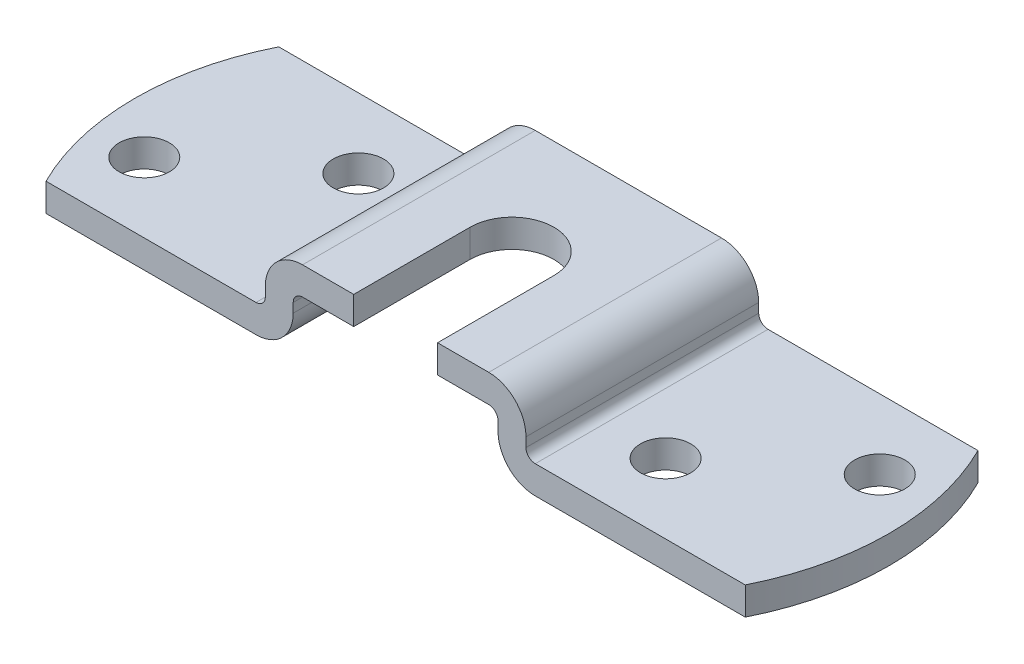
ISO-10303-21;
HEADER;
FILE_DESCRIPTION(('STEP AP214'),'2;1');
FILE_NAME('part.step','',(''),(''),'','','');
FILE_SCHEMA(('AUTOMOTIVE_DESIGN { 1 0 10303 214 1 1 1 1 }'));
ENDSEC;
DATA;
#1=APPLICATION_CONTEXT('core data for automotive mechanical design processes');
#2=APPLICATION_PROTOCOL_DEFINITION('international standard','automotive_design',2000,#1);
#3=PRODUCT_CONTEXT('',#1,'mechanical');
#4=PRODUCT('Part','Part','',(#3));
#5=PRODUCT_RELATED_PRODUCT_CATEGORY('part','',(#4));
#6=PRODUCT_DEFINITION_FORMATION('','',#4);
#7=PRODUCT_DEFINITION_CONTEXT('part definition',#1,'design');
#8=PRODUCT_DEFINITION('design','',#6,#7);
#9=PRODUCT_DEFINITION_SHAPE('','',#8);
#10=(LENGTH_UNIT() NAMED_UNIT(*) SI_UNIT(.MILLI.,.METRE.));
#11=(NAMED_UNIT(*) PLANE_ANGLE_UNIT() SI_UNIT($,.RADIAN.));
#12=(NAMED_UNIT(*) SI_UNIT($,.STERADIAN.) SOLID_ANGLE_UNIT());
#13=UNCERTAINTY_MEASURE_WITH_UNIT(LENGTH_MEASURE(1.E-05),#10,'distance_accuracy_value','');
#14=(GEOMETRIC_REPRESENTATION_CONTEXT(3) GLOBAL_UNCERTAINTY_ASSIGNED_CONTEXT((#13)) GLOBAL_UNIT_ASSIGNED_CONTEXT((#10,
#11,#12)) REPRESENTATION_CONTEXT('',''));
#15=CARTESIAN_POINT('',(0.,0.,0.));
#16=DIRECTION('',(0.,0.,1.));
#17=DIRECTION('',(1.,0.,0.));
#18=AXIS2_PLACEMENT_3D('',#15,#16,#17);
#19=CARTESIAN_POINT('',(10.,-4.,25.));
#20=DIRECTION('',(0.,0.,-1.));
#21=DIRECTION('',(-1.,0.,0.));
#22=AXIS2_PLACEMENT_3D('',#19,#20,#21);
#23=PLANE('',#22);
#24=DIRECTION('',(1.,0.,0.));
#25=VECTOR('',#24,1.);
#26=CARTESIAN_POINT('',(10.,-3.,25.));
#27=LINE('',#26,#25);
#28=CARTESIAN_POINT('',(-10.,-3.,25.));
#29=VERTEX_POINT('',#28);
#30=CARTESIAN_POINT('',(-4.5,-3.,25.));
#31=VERTEX_POINT('',#30);
#32=EDGE_CURVE('E277',#29,#31,#27,.T.);
#33=ORIENTED_EDGE('',*,*,#32,.T.);
#34=DIRECTION('',(0.,1.,0.));
#35=VECTOR('',#34,1.);
#36=CARTESIAN_POINT('',(-4.5,-9.00000000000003,25.));
#37=LINE('',#36,#35);
#38=CARTESIAN_POINT('',(-4.5,0.,25.));
#39=VERTEX_POINT('',#38);
#40=EDGE_CURVE('E391',#31,#39,#37,.T.);
#41=ORIENTED_EDGE('',*,*,#40,.T.);
#42=DIRECTION('',(-1.,0.,0.));
#43=VECTOR('',#42,1.);
#44=CARTESIAN_POINT('',(10.,0.,25.));
#45=LINE('',#44,#43);
#46=CARTESIAN_POINT('',(-10.,0.,25.));
#47=VERTEX_POINT('',#46);
#48=EDGE_CURVE('E255',#39,#47,#45,.T.);
#49=ORIENTED_EDGE('',*,*,#48,.T.);
#50=CARTESIAN_POINT('',(-10.,-4.,25.));
#51=DIRECTION('',(0.,0.,1.));
#52=DIRECTION('',(1.,0.,0.));
#53=AXIS2_PLACEMENT_3D('',#50,#51,#52);
#54=CIRCLE('',#53,4.);
#55=CARTESIAN_POINT('',(-14.,-4.,25.));
#56=VERTEX_POINT('',#55);
#57=EDGE_CURVE('E254',#47,#56,#54,.T.);
#58=ORIENTED_EDGE('',*,*,#57,.T.);
#59=DIRECTION('',(0.,-1.,0.));
#60=VECTOR('',#59,1.);
#61=CARTESIAN_POINT('',(-14.,-4.,25.));
#62=LINE('',#61,#60);
#63=CARTESIAN_POINT('',(-14.,-5.,25.));
#64=VERTEX_POINT('',#63);
#65=EDGE_CURVE('E257',#56,#64,#62,.T.);
#66=ORIENTED_EDGE('',*,*,#65,.T.);
#67=CARTESIAN_POINT('',(-15.,-5.,25.));
#68=DIRECTION('',(0.,0.,-1.));
#69=DIRECTION('',(-1.,0.,0.));
#70=AXIS2_PLACEMENT_3D('',#67,#68,#69);
#71=CIRCLE('',#70,1.);
#72=CARTESIAN_POINT('',(-15.,-6.,25.));
#73=VERTEX_POINT('',#72);
#74=EDGE_CURVE('E263',#64,#73,#71,.T.);
#75=ORIENTED_EDGE('',*,*,#74,.T.);
#76=DIRECTION('',(-1.,0.,0.));
#77=VECTOR('',#76,1.);
#78=CARTESIAN_POINT('',(-15.,-6.,25.));
#79=LINE('',#78,#77);
#80=CARTESIAN_POINT('',(-37.5549396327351,-6.00000000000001,25.));
#81=VERTEX_POINT('',#80);
#82=EDGE_CURVE('E265',#73,#81,#79,.T.);
#83=ORIENTED_EDGE('',*,*,#82,.T.);
#84=DIRECTION('',(0.,1.,0.));
#85=VECTOR('',#84,1.);
#86=CARTESIAN_POINT('',(-37.5549396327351,-9.00000000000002,25.));
#87=LINE('',#86,#85);
#88=CARTESIAN_POINT('',(-37.5549396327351,-9.00000000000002,25.));
#89=VERTEX_POINT('',#88);
#90=EDGE_CURVE('E406',#89,#81,#87,.T.);
#91=ORIENTED_EDGE('',*,*,#90,.F.);
#92=DIRECTION('',(1.,0.,0.));
#93=VECTOR('',#92,1.);
#94=CARTESIAN_POINT('',(-15.,-9.,25.));
#95=LINE('',#94,#93);
#96=CARTESIAN_POINT('',(-15.,-9.,25.));
#97=VERTEX_POINT('',#96);
#98=EDGE_CURVE('E268',#89,#97,#95,.T.);
#99=ORIENTED_EDGE('',*,*,#98,.T.);
#100=CARTESIAN_POINT('',(-15.,-5.,25.));
#101=DIRECTION('',(0.,0.,1.));
#102=DIRECTION('',(-1.,0.,0.));
#103=AXIS2_PLACEMENT_3D('',#100,#101,#102);
#104=CIRCLE('',#103,4.);
#105=CARTESIAN_POINT('',(-11.,-5.,25.));
#106=VERTEX_POINT('',#105);
#107=EDGE_CURVE('E270',#97,#106,#104,.T.);
#108=ORIENTED_EDGE('',*,*,#107,.T.);
#109=DIRECTION('',(0.,1.,0.));
#110=VECTOR('',#109,1.);
#111=CARTESIAN_POINT('',(-11.,-4.,25.));
#112=LINE('',#111,#110);
#113=CARTESIAN_POINT('',(-11.,-4.,25.));
#114=VERTEX_POINT('',#113);
#115=EDGE_CURVE('E272',#106,#114,#112,.T.);
#116=ORIENTED_EDGE('',*,*,#115,.T.);
#117=CARTESIAN_POINT('',(-10.,-4.,25.));
#118=DIRECTION('',(0.,0.,-1.));
#119=DIRECTION('',(1.,0.,0.));
#120=AXIS2_PLACEMENT_3D('',#117,#118,#119);
#121=CIRCLE('',#120,1.);
#122=EDGE_CURVE('E274',#114,#29,#121,.T.);
#123=ORIENTED_EDGE('',*,*,#122,.T.);
#124=EDGE_LOOP('',(#33,#41,#49,#58,#66,#75,#83,#91,#99,#108,#116,#123));
#125=FACE_BOUND('',#124,.T.);
#126=ADVANCED_FACE('F68',(#125),#23,.F.);
#127=CARTESIAN_POINT('',(-15.,-6.,25.));
#128=DIRECTION('',(0.,-1.,0.));
#129=DIRECTION('',(1.,0.,0.));
#130=AXIS2_PLACEMENT_3D('',#127,#128,#129);
#131=PLANE('',#130);
#132=CARTESIAN_POINT('',(-21.5,-6.00000000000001,7.5));
#133=DIRECTION('',(0.,1.,0.));
#134=DIRECTION('',(-1.,0.,0.));
#135=AXIS2_PLACEMENT_3D('',#132,#133,#134);
#136=CIRCLE('',#135,2.7);
#137=CARTESIAN_POINT('',(-24.2,-6.00000000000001,7.5));
#138=VERTEX_POINT('',#137);
#139=EDGE_CURVE('E509',#138,#138,#136,.T.);
#140=ORIENTED_EDGE('',*,*,#139,.F.);
#141=EDGE_LOOP('',(#140));
#142=FACE_BOUND('',#141,.T.);
#143=CARTESIAN_POINT('',(-34.5,-6.00000000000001,17.5));
#144=DIRECTION('',(0.,1.,0.));
#145=DIRECTION('',(-1.,0.,0.));
#146=AXIS2_PLACEMENT_3D('',#143,#144,#145);
#147=CIRCLE('',#146,2.7);
#148=CARTESIAN_POINT('',(-37.2,-6.00000000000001,17.5));
#149=VERTEX_POINT('',#148);
#150=EDGE_CURVE('E503',#149,#149,#147,.T.);
#151=ORIENTED_EDGE('',*,*,#150,.F.);
#152=EDGE_LOOP('',(#151));
#153=FACE_BOUND('',#152,.T.);
#154=CARTESIAN_POINT('',(-12.5,-6.,12.5));
#155=DIRECTION('',(0.,1.,0.));
#156=DIRECTION('',(-1.,0.,0.));
#157=AXIS2_PLACEMENT_3D('',#154,#155,#156);
#158=CIRCLE('',#157,28.);
#159=CARTESIAN_POINT('',(-37.5549396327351,-6.00000000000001,0.));
#160=VERTEX_POINT('',#159);
#161=EDGE_CURVE('E409',#160,#81,#158,.T.);
#162=ORIENTED_EDGE('',*,*,#161,.T.);
#163=ORIENTED_EDGE('',*,*,#82,.F.);
#164=DIRECTION('',(0.,0.,-1.));
#165=VECTOR('',#164,1.);
#166=CARTESIAN_POINT('',(-15.,-6.,25.));
#167=LINE('',#166,#165);
#168=CARTESIAN_POINT('',(-15.,-6.,0.));
#169=VERTEX_POINT('',#168);
#170=EDGE_CURVE('E368',#73,#169,#167,.T.);
#171=ORIENTED_EDGE('',*,*,#170,.T.);
#172=DIRECTION('',(-1.,0.,0.));
#173=VECTOR('',#172,1.);
#174=CARTESIAN_POINT('',(-15.,-6.,0.));
#175=LINE('',#174,#173);
#176=EDGE_CURVE('E308',#169,#160,#175,.T.);
#177=ORIENTED_EDGE('',*,*,#176,.T.);
#178=EDGE_LOOP('',(#162,#163,#171,#177));
#179=FACE_BOUND('',#178,.T.);
#180=ADVANCED_FACE('F422',(#142,#153,#179),#131,.F.);
#181=CARTESIAN_POINT('',(-15.,-9.,25.));
#182=DIRECTION('',(0.,1.,0.));
#183=DIRECTION('',(-1.,0.,0.));
#184=AXIS2_PLACEMENT_3D('',#181,#182,#183);
#185=PLANE('',#184);
#186=CARTESIAN_POINT('',(-21.5,-9.00000000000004,7.5));
#187=DIRECTION('',(0.,1.,0.));
#188=DIRECTION('',(-1.,0.,0.));
#189=AXIS2_PLACEMENT_3D('',#186,#187,#188);
#190=CIRCLE('',#189,2.7);
#191=CARTESIAN_POINT('',(-24.2,-9.00000000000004,7.5));
#192=VERTEX_POINT('',#191);
#193=EDGE_CURVE('E506',#192,#192,#190,.T.);
#194=ORIENTED_EDGE('',*,*,#193,.T.);
#195=EDGE_LOOP('',(#194));
#196=FACE_BOUND('',#195,.T.);
#197=CARTESIAN_POINT('',(-34.5,-9.00000000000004,17.5));
#198=DIRECTION('',(0.,1.,0.));
#199=DIRECTION('',(-1.,0.,0.));
#200=AXIS2_PLACEMENT_3D('',#197,#198,#199);
#201=CIRCLE('',#200,2.7);
#202=CARTESIAN_POINT('',(-37.2,-9.00000000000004,17.5));
#203=VERTEX_POINT('',#202);
#204=EDGE_CURVE('E248',#203,#203,#201,.T.);
#205=ORIENTED_EDGE('',*,*,#204,.T.);
#206=EDGE_LOOP('',(#205));
#207=FACE_BOUND('',#206,.T.);
#208=ORIENTED_EDGE('',*,*,#98,.F.);
#209=CARTESIAN_POINT('',(-12.5,-9.00000000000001,12.5));
#210=DIRECTION('',(0.,1.,0.));
#211=DIRECTION('',(-1.,0.,0.));
#212=AXIS2_PLACEMENT_3D('',#209,#210,#211);
#213=CIRCLE('',#212,28.);
#214=CARTESIAN_POINT('',(-37.5549396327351,-9.00000000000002,0.));
#215=VERTEX_POINT('',#214);
#216=EDGE_CURVE('E410',#215,#89,#213,.T.);
#217=ORIENTED_EDGE('',*,*,#216,.F.);
#218=DIRECTION('',(1.,0.,0.));
#219=VECTOR('',#218,1.);
#220=CARTESIAN_POINT('',(-15.,-9.,0.));
#221=LINE('',#220,#219);
#222=CARTESIAN_POINT('',(-15.,-9.,0.));
#223=VERTEX_POINT('',#222);
#224=EDGE_CURVE('E311',#215,#223,#221,.T.);
#225=ORIENTED_EDGE('',*,*,#224,.T.);
#226=DIRECTION('',(0.,0.,-1.));
#227=VECTOR('',#226,1.);
#228=CARTESIAN_POINT('',(-15.,-9.,25.));
#229=LINE('',#228,#227);
#230=EDGE_CURVE('E365',#97,#223,#229,.T.);
#231=ORIENTED_EDGE('',*,*,#230,.F.);
#232=EDGE_LOOP('',(#208,#217,#225,#231));
#233=FACE_BOUND('',#232,.T.);
#234=ADVANCED_FACE('F496',(#196,#207,#233),#185,.F.);
#235=CARTESIAN_POINT('',(10.,0.,25.));
#236=VERTEX_POINT('',#235);
#237=CARTESIAN_POINT('',(4.5,0.,25.));
#238=VERTEX_POINT('',#237);
#239=EDGE_CURVE('E243',#236,#238,#45,.T.);
#240=ORIENTED_EDGE('',*,*,#239,.T.);
#241=DIRECTION('',(0.,1.,0.));
#242=VECTOR('',#241,1.);
#243=CARTESIAN_POINT('',(4.5,-9.00000000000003,25.));
#244=LINE('',#243,#242);
#245=CARTESIAN_POINT('',(4.5,-3.,25.));
#246=VERTEX_POINT('',#245);
#247=EDGE_CURVE('E227',#246,#238,#244,.T.);
#248=ORIENTED_EDGE('',*,*,#247,.F.);
#249=CARTESIAN_POINT('',(10.,-3.,25.));
#250=VERTEX_POINT('',#249);
#251=EDGE_CURVE('E276',#246,#250,#27,.T.);
#252=ORIENTED_EDGE('',*,*,#251,.T.);
#253=CARTESIAN_POINT('',(10.,-4.,25.));
#254=DIRECTION('',(0.,0.,-1.));
#255=DIRECTION('',(-1.,0.,0.));
#256=AXIS2_PLACEMENT_3D('',#253,#254,#255);
#257=CIRCLE('',#256,1.);
#258=CARTESIAN_POINT('',(11.,-4.,25.));
#259=VERTEX_POINT('',#258);
#260=EDGE_CURVE('E280',#250,#259,#257,.T.);
#261=ORIENTED_EDGE('',*,*,#260,.T.);
#262=DIRECTION('',(0.,-1.,0.));
#263=VECTOR('',#262,1.);
#264=CARTESIAN_POINT('',(11.,-4.,25.));
#265=LINE('',#264,#263);
#266=CARTESIAN_POINT('',(11.,-5.,25.));
#267=VERTEX_POINT('',#266);
#268=EDGE_CURVE('E282',#259,#267,#265,.T.);
#269=ORIENTED_EDGE('',*,*,#268,.T.);
#270=CARTESIAN_POINT('',(15.,-5.,25.));
#271=DIRECTION('',(0.,0.,1.));
#272=DIRECTION('',(1.,0.,0.));
#273=AXIS2_PLACEMENT_3D('',#270,#271,#272);
#274=CIRCLE('',#273,4.);
#275=CARTESIAN_POINT('',(15.,-9.,25.));
#276=VERTEX_POINT('',#275);
#277=EDGE_CURVE('E284',#267,#276,#274,.T.);
#278=ORIENTED_EDGE('',*,*,#277,.T.);
#279=DIRECTION('',(1.,0.,0.));
#280=VECTOR('',#279,1.);
#281=CARTESIAN_POINT('',(15.,-9.,25.));
#282=LINE('',#281,#280);
#283=CARTESIAN_POINT('',(37.5549396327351,-9.00000000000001,25.));
#284=VERTEX_POINT('',#283);
#285=EDGE_CURVE('E286',#276,#284,#282,.T.);
#286=ORIENTED_EDGE('',*,*,#285,.T.);
#287=DIRECTION('',(0.,1.,0.));
#288=VECTOR('',#287,1.);
#289=CARTESIAN_POINT('',(37.5549396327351,-9.00000000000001,25.));
#290=LINE('',#289,#288);
#291=CARTESIAN_POINT('',(37.5549396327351,-5.99999999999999,25.));
#292=VERTEX_POINT('',#291);
#293=EDGE_CURVE('E394',#284,#292,#290,.T.);
#294=ORIENTED_EDGE('',*,*,#293,.T.);
#295=DIRECTION('',(-1.,0.,0.));
#296=VECTOR('',#295,1.);
#297=CARTESIAN_POINT('',(15.,-6.,25.));
#298=LINE('',#297,#296);
#299=CARTESIAN_POINT('',(15.,-6.,25.));
#300=VERTEX_POINT('',#299);
#301=EDGE_CURVE('E289',#292,#300,#298,.T.);
#302=ORIENTED_EDGE('',*,*,#301,.T.);
#303=CARTESIAN_POINT('',(15.,-5.,25.));
#304=DIRECTION('',(0.,0.,-1.));
#305=DIRECTION('',(1.,0.,0.));
#306=AXIS2_PLACEMENT_3D('',#303,#304,#305);
#307=CIRCLE('',#306,1.);
#308=CARTESIAN_POINT('',(14.,-5.,25.));
#309=VERTEX_POINT('',#308);
#310=EDGE_CURVE('E291',#300,#309,#307,.T.);
#311=ORIENTED_EDGE('',*,*,#310,.T.);
#312=DIRECTION('',(0.,1.,0.));
#313=VECTOR('',#312,1.);
#314=CARTESIAN_POINT('',(14.,-4.,25.));
#315=LINE('',#314,#313);
#316=CARTESIAN_POINT('',(14.,-4.,25.));
#317=VERTEX_POINT('',#316);
#318=EDGE_CURVE('E293',#309,#317,#315,.T.);
#319=ORIENTED_EDGE('',*,*,#318,.T.);
#320=CARTESIAN_POINT('',(10.,-4.,25.));
#321=DIRECTION('',(0.,0.,1.));
#322=DIRECTION('',(-1.,0.,0.));
#323=AXIS2_PLACEMENT_3D('',#320,#321,#322);
#324=CIRCLE('',#323,4.);
#325=EDGE_CURVE('E252',#317,#236,#324,.T.);
#326=ORIENTED_EDGE('',*,*,#325,.T.);
#327=EDGE_LOOP('',(#240,#248,#252,#261,#269,#278,#286,#294,#302,#311,#319,#326));
#328=FACE_BOUND('',#327,.T.);
#329=ADVANCED_FACE('F250',(#328),#23,.F.);
#330=CARTESIAN_POINT('',(10.,-4.,0.));
#331=DIRECTION('',(0.,0.,-1.));
#332=DIRECTION('',(-1.,0.,0.));
#333=AXIS2_PLACEMENT_3D('',#330,#331,#332);
#334=PLANE('',#333);
#335=DIRECTION('',(0.,1.,0.));
#336=VECTOR('',#335,1.);
#337=CARTESIAN_POINT('',(37.5549396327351,-9.00000000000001,0.));
#338=LINE('',#337,#336);
#339=CARTESIAN_POINT('',(37.5549396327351,-9.00000000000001,0.));
#340=VERTEX_POINT('',#339);
#341=CARTESIAN_POINT('',(37.5549396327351,-6.,0.));
#342=VERTEX_POINT('',#341);
#343=EDGE_CURVE('E91',#340,#342,#338,.T.);
#344=ORIENTED_EDGE('',*,*,#343,.F.);
#345=DIRECTION('',(1.,0.,0.));
#346=VECTOR('',#345,1.);
#347=CARTESIAN_POINT('',(15.,-9.,0.));
#348=LINE('',#347,#346);
#349=CARTESIAN_POINT('',(15.,-9.,0.));
#350=VERTEX_POINT('',#349);
#351=EDGE_CURVE('E327',#350,#340,#348,.T.);
#352=ORIENTED_EDGE('',*,*,#351,.F.);
#353=CARTESIAN_POINT('',(15.,-5.,0.));
#354=DIRECTION('',(0.,0.,1.));
#355=DIRECTION('',(1.,0.,0.));
#356=AXIS2_PLACEMENT_3D('',#353,#354,#355);
#357=CIRCLE('',#356,4.);
#358=CARTESIAN_POINT('',(11.,-5.,0.));
#359=VERTEX_POINT('',#358);
#360=EDGE_CURVE('E325',#359,#350,#357,.T.);
#361=ORIENTED_EDGE('',*,*,#360,.F.);
#362=DIRECTION('',(0.,-1.,0.));
#363=VECTOR('',#362,1.);
#364=CARTESIAN_POINT('',(11.,-4.,0.));
#365=LINE('',#364,#363);
#366=CARTESIAN_POINT('',(11.,-4.,0.));
#367=VERTEX_POINT('',#366);
#368=EDGE_CURVE('E323',#367,#359,#365,.T.);
#369=ORIENTED_EDGE('',*,*,#368,.F.);
#370=CARTESIAN_POINT('',(10.,-4.,0.));
#371=DIRECTION('',(0.,0.,-1.));
#372=DIRECTION('',(-1.,0.,0.));
#373=AXIS2_PLACEMENT_3D('',#370,#371,#372);
#374=CIRCLE('',#373,1.);
#375=CARTESIAN_POINT('',(10.,-3.,0.));
#376=VERTEX_POINT('',#375);
#377=EDGE_CURVE('E321',#376,#367,#374,.T.);
#378=ORIENTED_EDGE('',*,*,#377,.F.);
#379=DIRECTION('',(1.,0.,0.));
#380=VECTOR('',#379,1.);
#381=CARTESIAN_POINT('',(10.,-3.,0.));
#382=LINE('',#381,#380);
#383=CARTESIAN_POINT('',(-10.,-3.,0.));
#384=VERTEX_POINT('',#383);
#385=EDGE_CURVE('E319',#384,#376,#382,.T.);
#386=ORIENTED_EDGE('',*,*,#385,.F.);
#387=CARTESIAN_POINT('',(-10.,-4.,0.));
#388=DIRECTION('',(0.,0.,-1.));
#389=DIRECTION('',(1.,0.,0.));
#390=AXIS2_PLACEMENT_3D('',#387,#388,#389);
#391=CIRCLE('',#390,1.);
#392=CARTESIAN_POINT('',(-11.,-4.,0.));
#393=VERTEX_POINT('',#392);
#394=EDGE_CURVE('E317',#393,#384,#391,.T.);
#395=ORIENTED_EDGE('',*,*,#394,.F.);
#396=DIRECTION('',(0.,1.,0.));
#397=VECTOR('',#396,1.);
#398=CARTESIAN_POINT('',(-11.,-4.,0.));
#399=LINE('',#398,#397);
#400=CARTESIAN_POINT('',(-11.,-5.,0.));
#401=VERTEX_POINT('',#400);
#402=EDGE_CURVE('E315',#401,#393,#399,.T.);
#403=ORIENTED_EDGE('',*,*,#402,.F.);
#404=CARTESIAN_POINT('',(-15.,-5.,0.));
#405=DIRECTION('',(0.,0.,1.));
#406=DIRECTION('',(-1.,0.,0.));
#407=AXIS2_PLACEMENT_3D('',#404,#405,#406);
#408=CIRCLE('',#407,4.);
#409=EDGE_CURVE('E313',#223,#401,#408,.T.);
#410=ORIENTED_EDGE('',*,*,#409,.F.);
#411=ORIENTED_EDGE('',*,*,#224,.F.);
#412=DIRECTION('',(0.,1.,0.));
#413=VECTOR('',#412,1.);
#414=CARTESIAN_POINT('',(-37.5549396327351,-9.00000000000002,0.));
#415=LINE('',#414,#413);
#416=EDGE_CURVE('E300',#215,#160,#415,.T.);
#417=ORIENTED_EDGE('',*,*,#416,.T.);
#418=ORIENTED_EDGE('',*,*,#176,.F.);
#419=CARTESIAN_POINT('',(-15.,-5.,0.));
#420=DIRECTION('',(0.,0.,-1.));
#421=DIRECTION('',(-1.,0.,0.));
#422=AXIS2_PLACEMENT_3D('',#419,#420,#421);
#423=CIRCLE('',#422,1.);
#424=CARTESIAN_POINT('',(-14.,-5.,0.));
#425=VERTEX_POINT('',#424);
#426=EDGE_CURVE('E306',#425,#169,#423,.T.);
#427=ORIENTED_EDGE('',*,*,#426,.F.);
#428=DIRECTION('',(0.,-1.,0.));
#429=VECTOR('',#428,1.);
#430=CARTESIAN_POINT('',(-14.,-4.,0.));
#431=LINE('',#430,#429);
#432=CARTESIAN_POINT('',(-14.,-4.,0.));
#433=VERTEX_POINT('',#432);
#434=EDGE_CURVE('E304',#433,#425,#431,.T.);
#435=ORIENTED_EDGE('',*,*,#434,.F.);
#436=CARTESIAN_POINT('',(-10.,-4.,0.));
#437=DIRECTION('',(0.,0.,1.));
#438=DIRECTION('',(1.,0.,0.));
#439=AXIS2_PLACEMENT_3D('',#436,#437,#438);
#440=CIRCLE('',#439,4.);
#441=CARTESIAN_POINT('',(-10.,0.,0.));
#442=VERTEX_POINT('',#441);
#443=EDGE_CURVE('E302',#442,#433,#440,.T.);
#444=ORIENTED_EDGE('',*,*,#443,.F.);
#445=DIRECTION('',(-1.,0.,0.));
#446=VECTOR('',#445,1.);
#447=CARTESIAN_POINT('',(10.,0.,0.));
#448=LINE('',#447,#446);
#449=CARTESIAN_POINT('',(10.,0.,0.));
#450=VERTEX_POINT('',#449);
#451=EDGE_CURVE('E299',#450,#442,#448,.T.);
#452=ORIENTED_EDGE('',*,*,#451,.F.);
#453=CARTESIAN_POINT('',(10.,-4.,0.));
#454=DIRECTION('',(0.,0.,1.));
#455=DIRECTION('',(-1.,0.,0.));
#456=AXIS2_PLACEMENT_3D('',#453,#454,#455);
#457=CIRCLE('',#456,4.);
#458=CARTESIAN_POINT('',(14.,-4.,0.));
#459=VERTEX_POINT('',#458);
#460=EDGE_CURVE('E296',#459,#450,#457,.T.);
#461=ORIENTED_EDGE('',*,*,#460,.F.);
#462=DIRECTION('',(0.,1.,0.));
#463=VECTOR('',#462,1.);
#464=CARTESIAN_POINT('',(14.,-4.,0.));
#465=LINE('',#464,#463);
#466=CARTESIAN_POINT('',(14.,-5.,0.));
#467=VERTEX_POINT('',#466);
#468=EDGE_CURVE('E334',#467,#459,#465,.T.);
#469=ORIENTED_EDGE('',*,*,#468,.F.);
#470=CARTESIAN_POINT('',(15.,-5.,0.));
#471=DIRECTION('',(0.,0.,-1.));
#472=DIRECTION('',(1.,0.,0.));
#473=AXIS2_PLACEMENT_3D('',#470,#471,#472);
#474=CIRCLE('',#473,1.);
#475=CARTESIAN_POINT('',(15.,-6.,0.));
#476=VERTEX_POINT('',#475);
#477=EDGE_CURVE('E332',#476,#467,#474,.T.);
#478=ORIENTED_EDGE('',*,*,#477,.F.);
#479=DIRECTION('',(-1.,0.,0.));
#480=VECTOR('',#479,1.);
#481=CARTESIAN_POINT('',(15.,-6.,0.));
#482=LINE('',#481,#480);
#483=EDGE_CURVE('E330',#342,#476,#482,.T.);
#484=ORIENTED_EDGE('',*,*,#483,.F.);
#485=EDGE_LOOP('',(#344,#352,#361,#369,#378,#386,#395,#403,#410,#411,#417,#418,#427,#435,#444,
#452,#461,#469,#478,#484));
#486=FACE_BOUND('',#485,.T.);
#487=ADVANCED_FACE('F416',(#486),#334,.T.);
#488=CARTESIAN_POINT('',(10.,-4.,25.));
#489=DIRECTION('',(0.,0.,-1.));
#490=DIRECTION('',(-1.,0.,0.));
#491=AXIS2_PLACEMENT_3D('',#488,#489,#490);
#492=CYLINDRICAL_SURFACE('',#491,4.);
#493=ORIENTED_EDGE('',*,*,#460,.T.);
#494=DIRECTION('',(0.,0.,-1.));
#495=VECTOR('',#494,1.);
#496=CARTESIAN_POINT('',(10.,0.,25.));
#497=LINE('',#496,#495);
#498=EDGE_CURVE('E380',#236,#450,#497,.T.);
#499=ORIENTED_EDGE('',*,*,#498,.F.);
#500=ORIENTED_EDGE('',*,*,#325,.F.);
#501=DIRECTION('',(0.,0.,-1.));
#502=VECTOR('',#501,1.);
#503=CARTESIAN_POINT('',(14.,-4.,25.));
#504=LINE('',#503,#502);
#505=EDGE_CURVE('E295',#317,#459,#504,.T.);
#506=ORIENTED_EDGE('',*,*,#505,.T.);
#507=EDGE_LOOP('',(#493,#499,#500,#506));
#508=FACE_BOUND('',#507,.T.);
#509=ADVANCED_FACE('F70',(#508),#492,.T.);
#510=CARTESIAN_POINT('',(10.,0.,25.));
#511=DIRECTION('',(0.,-1.,0.));
#512=DIRECTION('',(1.,0.,0.));
#513=AXIS2_PLACEMENT_3D('',#510,#511,#512);
#514=PLANE('',#513);
#515=ORIENTED_EDGE('',*,*,#48,.F.);
#516=DIRECTION('',(0.,0.,1.));
#517=VECTOR('',#516,1.);
#518=CARTESIAN_POINT('',(-4.5,0.,25.));
#519=LINE('',#518,#517);
#520=CARTESIAN_POINT('',(-4.5,0.,12.5));
#521=VERTEX_POINT('',#520);
#522=EDGE_CURVE('E237',#521,#39,#519,.T.);
#523=ORIENTED_EDGE('',*,*,#522,.F.);
#524=CARTESIAN_POINT('',(0.,0.,12.5));
#525=DIRECTION('',(0.,1.,0.));
#526=DIRECTION('',(1.,0.,0.));
#527=AXIS2_PLACEMENT_3D('',#524,#525,#526);
#528=CIRCLE('',#527,4.5);
#529=CARTESIAN_POINT('',(4.5,0.,12.5));
#530=VERTEX_POINT('',#529);
#531=EDGE_CURVE('E247',#530,#521,#528,.T.);
#532=ORIENTED_EDGE('',*,*,#531,.F.);
#533=DIRECTION('',(0.,0.,-1.));
#534=VECTOR('',#533,1.);
#535=CARTESIAN_POINT('',(4.5,0.,12.5));
#536=LINE('',#535,#534);
#537=EDGE_CURVE('E230',#238,#530,#536,.T.);
#538=ORIENTED_EDGE('',*,*,#537,.F.);
#539=ORIENTED_EDGE('',*,*,#239,.F.);
#540=ORIENTED_EDGE('',*,*,#498,.T.);
#541=ORIENTED_EDGE('',*,*,#451,.T.);
#542=DIRECTION('',(0.,0.,-1.));
#543=VECTOR('',#542,1.);
#544=CARTESIAN_POINT('',(-10.,0.,25.));
#545=LINE('',#544,#543);
#546=EDGE_CURVE('E377',#47,#442,#545,.T.);
#547=ORIENTED_EDGE('',*,*,#546,.F.);
#548=EDGE_LOOP('',(#515,#523,#532,#538,#539,#540,#541,#547));
#549=FACE_BOUND('',#548,.T.);
#550=ADVANCED_FACE('F241',(#549),#514,.F.);
#551=CARTESIAN_POINT('',(-10.,-4.,25.));
#552=DIRECTION('',(0.,0.,-1.));
#553=DIRECTION('',(-1.,0.,0.));
#554=AXIS2_PLACEMENT_3D('',#551,#552,#553);
#555=CYLINDRICAL_SURFACE('',#554,4.);
#556=ORIENTED_EDGE('',*,*,#443,.T.);
#557=DIRECTION('',(0.,0.,-1.));
#558=VECTOR('',#557,1.);
#559=CARTESIAN_POINT('',(-14.,-4.,25.));
#560=LINE('',#559,#558);
#561=EDGE_CURVE('E374',#56,#433,#560,.T.);
#562=ORIENTED_EDGE('',*,*,#561,.F.);
#563=ORIENTED_EDGE('',*,*,#57,.F.);
#564=ORIENTED_EDGE('',*,*,#546,.T.);
#565=EDGE_LOOP('',(#556,#562,#563,#564));
#566=FACE_BOUND('',#565,.T.);
#567=ADVANCED_FACE('F437',(#566),#555,.T.);
#568=CARTESIAN_POINT('',(-14.,-4.,25.));
#569=DIRECTION('',(1.,0.,0.));
#570=DIRECTION('',(0.,0.,-1.));
#571=AXIS2_PLACEMENT_3D('',#568,#569,#570);
#572=PLANE('',#571);
#573=ORIENTED_EDGE('',*,*,#434,.T.);
#574=DIRECTION('',(0.,0.,-1.));
#575=VECTOR('',#574,1.);
#576=CARTESIAN_POINT('',(-14.,-5.,25.));
#577=LINE('',#576,#575);
#578=EDGE_CURVE('E371',#64,#425,#577,.T.);
#579=ORIENTED_EDGE('',*,*,#578,.F.);
#580=ORIENTED_EDGE('',*,*,#65,.F.);
#581=ORIENTED_EDGE('',*,*,#561,.T.);
#582=EDGE_LOOP('',(#573,#579,#580,#581));
#583=FACE_BOUND('',#582,.T.);
#584=ADVANCED_FACE('F432',(#583),#572,.F.);
#585=CARTESIAN_POINT('',(-15.,-5.,25.));
#586=DIRECTION('',(0.,0.,-1.));
#587=DIRECTION('',(-1.,0.,0.));
#588=AXIS2_PLACEMENT_3D('',#585,#586,#587);
#589=CYLINDRICAL_SURFACE('',#588,1.);
#590=ORIENTED_EDGE('',*,*,#426,.T.);
#591=ORIENTED_EDGE('',*,*,#170,.F.);
#592=ORIENTED_EDGE('',*,*,#74,.F.);
#593=ORIENTED_EDGE('',*,*,#578,.T.);
#594=EDGE_LOOP('',(#590,#591,#592,#593));
#595=FACE_BOUND('',#594,.T.);
#596=ADVANCED_FACE('F427',(#595),#589,.F.);
#597=CARTESIAN_POINT('',(-15.,-5.,25.));
#598=DIRECTION('',(0.,0.,-1.));
#599=DIRECTION('',(-1.,0.,0.));
#600=AXIS2_PLACEMENT_3D('',#597,#598,#599);
#601=CYLINDRICAL_SURFACE('',#600,4.);
#602=ORIENTED_EDGE('',*,*,#409,.T.);
#603=DIRECTION('',(0.,0.,-1.));
#604=VECTOR('',#603,1.);
#605=CARTESIAN_POINT('',(-11.,-5.,25.));
#606=LINE('',#605,#604);
#607=EDGE_CURVE('E362',#106,#401,#606,.T.);
#608=ORIENTED_EDGE('',*,*,#607,.F.);
#609=ORIENTED_EDGE('',*,*,#107,.F.);
#610=ORIENTED_EDGE('',*,*,#230,.T.);
#611=EDGE_LOOP('',(#602,#608,#609,#610));
#612=FACE_BOUND('',#611,.T.);
#613=ADVANCED_FACE('F491',(#612),#601,.T.);
#614=CARTESIAN_POINT('',(-11.,-4.,25.));
#615=DIRECTION('',(-1.,0.,0.));
#616=DIRECTION('',(0.,-1.,0.));
#617=AXIS2_PLACEMENT_3D('',#614,#615,#616);
#618=PLANE('',#617);
#619=ORIENTED_EDGE('',*,*,#402,.T.);
#620=DIRECTION('',(0.,0.,-1.));
#621=VECTOR('',#620,1.);
#622=CARTESIAN_POINT('',(-11.,-4.,25.));
#623=LINE('',#622,#621);
#624=EDGE_CURVE('E359',#114,#393,#623,.T.);
#625=ORIENTED_EDGE('',*,*,#624,.F.);
#626=ORIENTED_EDGE('',*,*,#115,.F.);
#627=ORIENTED_EDGE('',*,*,#607,.T.);
#628=EDGE_LOOP('',(#619,#625,#626,#627));
#629=FACE_BOUND('',#628,.T.);
#630=ADVANCED_FACE('F488',(#629),#618,.F.);
#631=CARTESIAN_POINT('',(-10.,-4.,25.));
#632=DIRECTION('',(0.,0.,-1.));
#633=DIRECTION('',(-1.,0.,0.));
#634=AXIS2_PLACEMENT_3D('',#631,#632,#633);
#635=CYLINDRICAL_SURFACE('',#634,1.);
#636=ORIENTED_EDGE('',*,*,#394,.T.);
#637=DIRECTION('',(0.,0.,-1.));
#638=VECTOR('',#637,1.);
#639=CARTESIAN_POINT('',(-10.,-3.,25.));
#640=LINE('',#639,#638);
#641=EDGE_CURVE('E356',#29,#384,#640,.T.);
#642=ORIENTED_EDGE('',*,*,#641,.F.);
#643=ORIENTED_EDGE('',*,*,#122,.F.);
#644=ORIENTED_EDGE('',*,*,#624,.T.);
#645=EDGE_LOOP('',(#636,#642,#643,#644));
#646=FACE_BOUND('',#645,.T.);
#647=ADVANCED_FACE('F484',(#646),#635,.F.);
#648=CARTESIAN_POINT('',(10.,-3.,25.));
#649=DIRECTION('',(0.,1.,0.));
#650=DIRECTION('',(-1.,0.,0.));
#651=AXIS2_PLACEMENT_3D('',#648,#649,#650);
#652=PLANE('',#651);
#653=CARTESIAN_POINT('',(0.,-3.,12.5));
#654=DIRECTION('',(0.,1.,0.));
#655=DIRECTION('',(-1.,0.,0.));
#656=AXIS2_PLACEMENT_3D('',#653,#654,#655);
#657=CIRCLE('',#656,4.5);
#658=CARTESIAN_POINT('',(4.5,-3.,12.5));
#659=VERTEX_POINT('',#658);
#660=CARTESIAN_POINT('',(-4.5,-3.,12.5));
#661=VERTEX_POINT('',#660);
#662=EDGE_CURVE('E76',#659,#661,#657,.T.);
#663=ORIENTED_EDGE('',*,*,#662,.T.);
#664=DIRECTION('',(0.,0.,1.));
#665=VECTOR('',#664,1.);
#666=CARTESIAN_POINT('',(-4.5,-3.,25.));
#667=LINE('',#666,#665);
#668=EDGE_CURVE('E12',#661,#31,#667,.T.);
#669=ORIENTED_EDGE('',*,*,#668,.T.);
#670=ORIENTED_EDGE('',*,*,#32,.F.);
#671=ORIENTED_EDGE('',*,*,#641,.T.);
#672=ORIENTED_EDGE('',*,*,#385,.T.);
#673=DIRECTION('',(0.,0.,-1.));
#674=VECTOR('',#673,1.);
#675=CARTESIAN_POINT('',(10.,-3.,25.));
#676=LINE('',#675,#674);
#677=EDGE_CURVE('E353',#250,#376,#676,.T.);
#678=ORIENTED_EDGE('',*,*,#677,.F.);
#679=ORIENTED_EDGE('',*,*,#251,.F.);
#680=DIRECTION('',(0.,0.,-1.));
#681=VECTOR('',#680,1.);
#682=CARTESIAN_POINT('',(4.5,-3.,25.));
#683=LINE('',#682,#681);
#684=EDGE_CURVE('E233',#246,#659,#683,.T.);
#685=ORIENTED_EDGE('',*,*,#684,.T.);
#686=EDGE_LOOP('',(#663,#669,#670,#671,#672,#678,#679,#685));
#687=FACE_BOUND('',#686,.T.);
#688=ADVANCED_FACE('F384',(#687),#652,.F.);
#689=CARTESIAN_POINT('',(10.,-4.,25.));
#690=DIRECTION('',(0.,0.,-1.));
#691=DIRECTION('',(-1.,0.,0.));
#692=AXIS2_PLACEMENT_3D('',#689,#690,#691);
#693=CYLINDRICAL_SURFACE('',#692,1.);
#694=ORIENTED_EDGE('',*,*,#377,.T.);
#695=DIRECTION('',(0.,0.,-1.));
#696=VECTOR('',#695,1.);
#697=CARTESIAN_POINT('',(11.,-4.,25.));
#698=LINE('',#697,#696);
#699=EDGE_CURVE('E350',#259,#367,#698,.T.);
#700=ORIENTED_EDGE('',*,*,#699,.F.);
#701=ORIENTED_EDGE('',*,*,#260,.F.);
#702=ORIENTED_EDGE('',*,*,#677,.T.);
#703=EDGE_LOOP('',(#694,#700,#701,#702));
#704=FACE_BOUND('',#703,.T.);
#705=ADVANCED_FACE('F476',(#704),#693,.F.);
#706=CARTESIAN_POINT('',(11.,-4.,25.));
#707=DIRECTION('',(1.,0.,0.));
#708=DIRECTION('',(0.,0.,-1.));
#709=AXIS2_PLACEMENT_3D('',#706,#707,#708);
#710=PLANE('',#709);
#711=ORIENTED_EDGE('',*,*,#368,.T.);
#712=DIRECTION('',(0.,0.,-1.));
#713=VECTOR('',#712,1.);
#714=CARTESIAN_POINT('',(11.,-5.,25.));
#715=LINE('',#714,#713);
#716=EDGE_CURVE('E347',#267,#359,#715,.T.);
#717=ORIENTED_EDGE('',*,*,#716,.F.);
#718=ORIENTED_EDGE('',*,*,#268,.F.);
#719=ORIENTED_EDGE('',*,*,#699,.T.);
#720=EDGE_LOOP('',(#711,#717,#718,#719));
#721=FACE_BOUND('',#720,.T.);
#722=ADVANCED_FACE('F472',(#721),#710,.F.);
#723=CARTESIAN_POINT('',(15.,-5.,25.));
#724=DIRECTION('',(0.,0.,-1.));
#725=DIRECTION('',(-1.,0.,0.));
#726=AXIS2_PLACEMENT_3D('',#723,#724,#725);
#727=CYLINDRICAL_SURFACE('',#726,4.);
#728=ORIENTED_EDGE('',*,*,#360,.T.);
#729=DIRECTION('',(0.,0.,-1.));
#730=VECTOR('',#729,1.);
#731=CARTESIAN_POINT('',(15.,-9.,25.));
#732=LINE('',#731,#730);
#733=EDGE_CURVE('E344',#276,#350,#732,.T.);
#734=ORIENTED_EDGE('',*,*,#733,.F.);
#735=ORIENTED_EDGE('',*,*,#277,.F.);
#736=ORIENTED_EDGE('',*,*,#716,.T.);
#737=EDGE_LOOP('',(#728,#734,#735,#736));
#738=FACE_BOUND('',#737,.T.);
#739=ADVANCED_FACE('F468',(#738),#727,.T.);
#740=CARTESIAN_POINT('',(15.,-9.,25.));
#741=DIRECTION('',(0.,1.,0.));
#742=DIRECTION('',(-1.,0.,0.));
#743=AXIS2_PLACEMENT_3D('',#740,#741,#742);
#744=PLANE('',#743);
#745=CARTESIAN_POINT('',(34.5,-9.00000000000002,7.5));
#746=DIRECTION('',(0.,1.,0.));
#747=DIRECTION('',(-1.,0.,0.));
#748=AXIS2_PLACEMENT_3D('',#745,#746,#747);
#749=CIRCLE('',#748,2.7);
#750=CARTESIAN_POINT('',(31.8,-9.00000000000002,7.5));
#751=VERTEX_POINT('',#750);
#752=EDGE_CURVE('E518',#751,#751,#749,.T.);
#753=ORIENTED_EDGE('',*,*,#752,.T.);
#754=EDGE_LOOP('',(#753));
#755=FACE_BOUND('',#754,.T.);
#756=CARTESIAN_POINT('',(21.5,-9.00000000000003,17.5));
#757=DIRECTION('',(0.,1.,0.));
#758=DIRECTION('',(-1.,0.,0.));
#759=AXIS2_PLACEMENT_3D('',#756,#757,#758);
#760=CIRCLE('',#759,2.7);
#761=CARTESIAN_POINT('',(18.8,-9.00000000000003,17.5));
#762=VERTEX_POINT('',#761);
#763=EDGE_CURVE('E512',#762,#762,#760,.T.);
#764=ORIENTED_EDGE('',*,*,#763,.T.);
#765=EDGE_LOOP('',(#764));
#766=FACE_BOUND('',#765,.T.);
#767=CARTESIAN_POINT('',(12.5,-9.00000000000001,12.5));
#768=DIRECTION('',(0.,1.,0.));
#769=DIRECTION('',(-1.,0.,0.));
#770=AXIS2_PLACEMENT_3D('',#767,#768,#769);
#771=CIRCLE('',#770,28.);
#772=EDGE_CURVE('E402',#340,#284,#771,.F.);
#773=ORIENTED_EDGE('',*,*,#772,.T.);
#774=ORIENTED_EDGE('',*,*,#285,.F.);
#775=ORIENTED_EDGE('',*,*,#733,.T.);
#776=ORIENTED_EDGE('',*,*,#351,.T.);
#777=EDGE_LOOP('',(#773,#774,#775,#776));
#778=FACE_BOUND('',#777,.T.);
#779=ADVANCED_FACE('F463',(#755,#766,#778),#744,.F.);
#780=CARTESIAN_POINT('',(15.,-6.,25.));
#781=DIRECTION('',(0.,-1.,0.));
#782=DIRECTION('',(0.,0.,-1.));
#783=AXIS2_PLACEMENT_3D('',#780,#781,#782);
#784=PLANE('',#783);
#785=CARTESIAN_POINT('',(34.5,-5.99999999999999,7.5));
#786=DIRECTION('',(0.,1.,0.));
#787=DIRECTION('',(-1.,0.,0.));
#788=AXIS2_PLACEMENT_3D('',#785,#786,#787);
#789=CIRCLE('',#788,2.7);
#790=CARTESIAN_POINT('',(31.8,-5.99999999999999,7.5));
#791=VERTEX_POINT('',#790);
#792=EDGE_CURVE('E521',#791,#791,#789,.T.);
#793=ORIENTED_EDGE('',*,*,#792,.F.);
#794=EDGE_LOOP('',(#793));
#795=FACE_BOUND('',#794,.T.);
#796=CARTESIAN_POINT('',(21.5,-5.99999999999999,17.5));
#797=DIRECTION('',(0.,1.,0.));
#798=DIRECTION('',(-1.,0.,0.));
#799=AXIS2_PLACEMENT_3D('',#796,#797,#798);
#800=CIRCLE('',#799,2.7);
#801=CARTESIAN_POINT('',(18.8,-5.99999999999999,17.5));
#802=VERTEX_POINT('',#801);
#803=EDGE_CURVE('E515',#802,#802,#800,.T.);
#804=ORIENTED_EDGE('',*,*,#803,.F.);
#805=EDGE_LOOP('',(#804));
#806=FACE_BOUND('',#805,.T.);
#807=ORIENTED_EDGE('',*,*,#301,.F.);
#808=CARTESIAN_POINT('',(12.5,-6.,12.5));
#809=DIRECTION('',(0.,1.,0.));
#810=DIRECTION('',(-1.,0.,0.));
#811=AXIS2_PLACEMENT_3D('',#808,#809,#810);
#812=CIRCLE('',#811,28.);
#813=EDGE_CURVE('E401',#342,#292,#812,.F.);
#814=ORIENTED_EDGE('',*,*,#813,.F.);
#815=ORIENTED_EDGE('',*,*,#483,.T.);
#816=DIRECTION('',(0.,0.,-1.));
#817=VECTOR('',#816,1.);
#818=CARTESIAN_POINT('',(15.,-6.,25.));
#819=LINE('',#818,#817);
#820=EDGE_CURVE('E341',#300,#476,#819,.T.);
#821=ORIENTED_EDGE('',*,*,#820,.F.);
#822=EDGE_LOOP('',(#807,#814,#815,#821));
#823=FACE_BOUND('',#822,.T.);
#824=ADVANCED_FACE('F456',(#795,#806,#823),#784,.F.);
#825=CARTESIAN_POINT('',(15.,-5.,25.));
#826=DIRECTION('',(0.,0.,-1.));
#827=DIRECTION('',(-1.,0.,0.));
#828=AXIS2_PLACEMENT_3D('',#825,#826,#827);
#829=CYLINDRICAL_SURFACE('',#828,1.);
#830=ORIENTED_EDGE('',*,*,#477,.T.);
#831=DIRECTION('',(0.,0.,-1.));
#832=VECTOR('',#831,1.);
#833=CARTESIAN_POINT('',(14.,-5.,25.));
#834=LINE('',#833,#832);
#835=EDGE_CURVE('E338',#309,#467,#834,.T.);
#836=ORIENTED_EDGE('',*,*,#835,.F.);
#837=ORIENTED_EDGE('',*,*,#310,.F.);
#838=ORIENTED_EDGE('',*,*,#820,.T.);
#839=EDGE_LOOP('',(#830,#836,#837,#838));
#840=FACE_BOUND('',#839,.T.);
#841=ADVANCED_FACE('F450',(#840),#829,.F.);
#842=CARTESIAN_POINT('',(14.,-4.,25.));
#843=DIRECTION('',(-1.,0.,0.));
#844=DIRECTION('',(0.,0.,1.));
#845=AXIS2_PLACEMENT_3D('',#842,#843,#844);
#846=PLANE('',#845);
#847=ORIENTED_EDGE('',*,*,#468,.T.);
#848=ORIENTED_EDGE('',*,*,#505,.F.);
#849=ORIENTED_EDGE('',*,*,#318,.F.);
#850=ORIENTED_EDGE('',*,*,#835,.T.);
#851=EDGE_LOOP('',(#847,#848,#849,#850));
#852=FACE_BOUND('',#851,.T.);
#853=ADVANCED_FACE('F446',(#852),#846,.F.);
#854=CARTESIAN_POINT('',(-12.5,-9.00000000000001,12.5));
#855=DIRECTION('',(0.,1.,0.));
#856=DIRECTION('',(-1.,0.,0.));
#857=AXIS2_PLACEMENT_3D('',#854,#855,#856);
#858=CYLINDRICAL_SURFACE('',#857,28.);
#859=ORIENTED_EDGE('',*,*,#161,.F.);
#860=ORIENTED_EDGE('',*,*,#416,.F.);
#861=ORIENTED_EDGE('',*,*,#216,.T.);
#862=ORIENTED_EDGE('',*,*,#90,.T.);
#863=EDGE_LOOP('',(#859,#860,#861,#862));
#864=FACE_BOUND('',#863,.T.);
#865=ADVANCED_FACE('F498',(#864),#858,.T.);
#866=CARTESIAN_POINT('',(12.5,-9.00000000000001,12.5));
#867=DIRECTION('',(0.,1.,0.));
#868=DIRECTION('',(-1.,0.,0.));
#869=AXIS2_PLACEMENT_3D('',#866,#867,#868);
#870=CYLINDRICAL_SURFACE('',#869,28.);
#871=ORIENTED_EDGE('',*,*,#813,.T.);
#872=ORIENTED_EDGE('',*,*,#293,.F.);
#873=ORIENTED_EDGE('',*,*,#772,.F.);
#874=ORIENTED_EDGE('',*,*,#343,.T.);
#875=EDGE_LOOP('',(#871,#872,#873,#874));
#876=FACE_BOUND('',#875,.T.);
#877=ADVANCED_FACE('F458',(#876),#870,.T.);
#878=CARTESIAN_POINT('',(-4.5,-9.00000000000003,25.));
#879=DIRECTION('',(-1.,0.,0.));
#880=DIRECTION('',(0.,0.,1.));
#881=AXIS2_PLACEMENT_3D('',#878,#879,#880);
#882=PLANE('',#881);
#883=DIRECTION('',(0.,1.,0.));
#884=VECTOR('',#883,1.);
#885=CARTESIAN_POINT('',(-4.5,-9.00000000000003,12.5));
#886=LINE('',#885,#884);
#887=EDGE_CURVE('E389',#661,#521,#886,.T.);
#888=ORIENTED_EDGE('',*,*,#887,.T.);
#889=ORIENTED_EDGE('',*,*,#522,.T.);
#890=ORIENTED_EDGE('',*,*,#40,.F.);
#891=ORIENTED_EDGE('',*,*,#668,.F.);
#892=EDGE_LOOP('',(#888,#889,#890,#891));
#893=FACE_BOUND('',#892,.T.);
#894=ADVANCED_FACE('F500',(#893),#882,.F.);
#895=CARTESIAN_POINT('',(0.,-9.00000000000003,12.5));
#896=DIRECTION('',(0.,1.,0.));
#897=DIRECTION('',(-1.,0.,0.));
#898=AXIS2_PLACEMENT_3D('',#895,#896,#897);
#899=CYLINDRICAL_SURFACE('',#898,4.5);
#900=DIRECTION('',(0.,1.,0.));
#901=VECTOR('',#900,1.);
#902=CARTESIAN_POINT('',(4.5,-9.00000000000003,12.5));
#903=LINE('',#902,#901);
#904=EDGE_CURVE('E83',#659,#530,#903,.T.);
#905=ORIENTED_EDGE('',*,*,#904,.T.);
#906=ORIENTED_EDGE('',*,*,#531,.T.);
#907=ORIENTED_EDGE('',*,*,#887,.F.);
#908=ORIENTED_EDGE('',*,*,#662,.F.);
#909=EDGE_LOOP('',(#905,#906,#907,#908));
#910=FACE_BOUND('',#909,.T.);
#911=ADVANCED_FACE('F388',(#910),#899,.F.);
#912=CARTESIAN_POINT('',(4.5,-9.00000000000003,12.5));
#913=DIRECTION('',(1.,0.,0.));
#914=DIRECTION('',(0.,0.,-1.));
#915=AXIS2_PLACEMENT_3D('',#912,#913,#914);
#916=PLANE('',#915);
#917=ORIENTED_EDGE('',*,*,#247,.T.);
#918=ORIENTED_EDGE('',*,*,#537,.T.);
#919=ORIENTED_EDGE('',*,*,#904,.F.);
#920=ORIENTED_EDGE('',*,*,#684,.F.);
#921=EDGE_LOOP('',(#917,#918,#919,#920));
#922=FACE_BOUND('',#921,.T.);
#923=ADVANCED_FACE('F229',(#922),#916,.F.);
#924=CARTESIAN_POINT('',(-34.5,-9.00000000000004,17.5));
#925=DIRECTION('',(0.,1.,0.));
#926=DIRECTION('',(-1.,0.,0.));
#927=AXIS2_PLACEMENT_3D('',#924,#925,#926);
#928=CYLINDRICAL_SURFACE('',#927,2.7);
#929=CARTESIAN_POINT('',(-37.2,-9.00000000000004,17.5));
#930=CARTESIAN_POINT('',(-37.2,-8.96875000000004,17.5));
#931=CARTESIAN_POINT('',(-37.2,-8.93750000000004,17.5));
#932=CARTESIAN_POINT('',(-37.2,-8.87500000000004,17.5));
#933=CARTESIAN_POINT('',(-37.2,-8.84375000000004,17.5));
#934=CARTESIAN_POINT('',(-37.2,-8.78125000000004,17.5));
#935=CARTESIAN_POINT('',(-37.2,-8.75000000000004,17.5));
#936=CARTESIAN_POINT('',(-37.2,-8.68750000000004,17.5));
#937=CARTESIAN_POINT('',(-37.2,-8.65625000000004,17.5));
#938=CARTESIAN_POINT('',(-37.2,-8.59375000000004,17.5));
#939=CARTESIAN_POINT('',(-37.2,-8.56250000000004,17.5));
#940=CARTESIAN_POINT('',(-37.2,-8.50000000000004,17.5));
#941=CARTESIAN_POINT('',(-37.2,-8.46875000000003,17.5));
#942=CARTESIAN_POINT('',(-37.2,-8.40625000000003,17.5));
#943=CARTESIAN_POINT('',(-37.2,-8.37500000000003,17.5));
#944=CARTESIAN_POINT('',(-37.2,-8.31250000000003,17.5));
#945=CARTESIAN_POINT('',(-37.2,-8.28125000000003,17.5));
#946=CARTESIAN_POINT('',(-37.2,-8.21875000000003,17.5));
#947=CARTESIAN_POINT('',(-37.2,-8.18750000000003,17.5));
#948=CARTESIAN_POINT('',(-37.2,-8.12500000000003,17.5));
#949=CARTESIAN_POINT('',(-37.2,-8.09375000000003,17.5));
#950=CARTESIAN_POINT('',(-37.2,-8.03125000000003,17.5));
#951=CARTESIAN_POINT('',(-37.2,-8.00000000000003,17.5));
#952=CARTESIAN_POINT('',(-37.2,-7.93750000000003,17.5));
#953=CARTESIAN_POINT('',(-37.2,-7.90625000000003,17.5));
#954=CARTESIAN_POINT('',(-37.2,-7.84375000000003,17.5));
#955=CARTESIAN_POINT('',(-37.2,-7.81250000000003,17.5));
#956=CARTESIAN_POINT('',(-37.2,-7.75000000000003,17.5));
#957=CARTESIAN_POINT('',(-37.2,-7.71875000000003,17.5));
#958=CARTESIAN_POINT('',(-37.2,-7.65625000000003,17.5));
#959=CARTESIAN_POINT('',(-37.2,-7.62500000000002,17.5));
#960=CARTESIAN_POINT('',(-37.2,-7.56250000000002,17.5));
#961=CARTESIAN_POINT('',(-37.2,-7.53125000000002,17.5));
#962=CARTESIAN_POINT('',(-37.2,-7.46875000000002,17.5));
#963=CARTESIAN_POINT('',(-37.2,-7.43750000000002,17.5));
#964=CARTESIAN_POINT('',(-37.2,-7.37500000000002,17.5));
#965=CARTESIAN_POINT('',(-37.2,-7.34375000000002,17.5));
#966=CARTESIAN_POINT('',(-37.2,-7.28125000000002,17.5));
#967=CARTESIAN_POINT('',(-37.2,-7.25000000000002,17.5));
#968=CARTESIAN_POINT('',(-37.2,-7.18750000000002,17.5));
#969=CARTESIAN_POINT('',(-37.2,-7.15625000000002,17.5));
#970=CARTESIAN_POINT('',(-37.2,-7.09375000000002,17.5));
#971=CARTESIAN_POINT('',(-37.2,-7.06250000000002,17.5));
#972=CARTESIAN_POINT('',(-37.2,-7.00000000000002,17.5));
#973=CARTESIAN_POINT('',(-37.2,-6.96875000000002,17.5));
#974=CARTESIAN_POINT('',(-37.2,-6.90625000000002,17.5));
#975=CARTESIAN_POINT('',(-37.2,-6.87500000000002,17.5));
#976=CARTESIAN_POINT('',(-37.2,-6.81250000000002,17.5));
#977=CARTESIAN_POINT('',(-37.2,-6.78125000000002,17.5));
#978=CARTESIAN_POINT('',(-37.2,-6.71875000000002,17.5));
#979=CARTESIAN_POINT('',(-37.2,-6.68750000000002,17.5));
#980=CARTESIAN_POINT('',(-37.2,-6.62500000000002,17.5));
#981=CARTESIAN_POINT('',(-37.2,-6.59375000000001,17.5));
#982=CARTESIAN_POINT('',(-37.2,-6.53125000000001,17.5));
#983=CARTESIAN_POINT('',(-37.2,-6.50000000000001,17.5));
#984=CARTESIAN_POINT('',(-37.2,-6.43750000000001,17.5));
#985=CARTESIAN_POINT('',(-37.2,-6.40625000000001,17.5));
#986=CARTESIAN_POINT('',(-37.2,-6.34375000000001,17.5));
#987=CARTESIAN_POINT('',(-37.2,-6.31250000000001,17.5));
#988=CARTESIAN_POINT('',(-37.2,-6.25000000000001,17.5));
#989=CARTESIAN_POINT('',(-37.2,-6.21875000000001,17.5));
#990=CARTESIAN_POINT('',(-37.2,-6.15625000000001,17.5));
#991=CARTESIAN_POINT('',(-37.2,-6.12500000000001,17.5));
#992=CARTESIAN_POINT('',(-37.2,-6.06250000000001,17.5));
#993=CARTESIAN_POINT('',(-37.2,-6.03125000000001,17.5));
#994=CARTESIAN_POINT('',(-37.2,-6.00000000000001,17.5));
#995=B_SPLINE_CURVE_WITH_KNOTS('',3,(#929,#930,#931,#932,#933,#934,#935,#936,#937,#938,#939,
#940,#941,#942,#943,#944,#945,#946,#947,#948,#949,#950,#951,#952,#953,#954,#955,#956,#957,#958,
#959,#960,#961,#962,#963,#964,#965,#966,#967,#968,#969,#970,#971,#972,#973,#974,#975,#976,#977,
#978,#979,#980,#981,#982,#983,#984,#985,#986,#987,#988,#989,#990,#991,#992,#993,#994),
.UNSPECIFIED.,.F.,.F.,(4,2,2,2,2,2,2,2,2,2,2,2,2,2,2,2,2,2,2,2,2,2,2,2,2,2,2,2,2,2,2,2,4),(0.,
0.0937500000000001,0.187500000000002,0.281250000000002,0.375000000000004,0.468750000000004,
0.562500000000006,0.656250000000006,0.750000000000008,0.843750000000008,0.93750000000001,
1.03125000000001,1.12500000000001,1.21875000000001,1.31250000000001,1.40625000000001,
1.50000000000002,1.59375000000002,1.68750000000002,1.78125000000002,1.87500000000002,
1.96875000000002,2.06250000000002,2.15625000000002,2.25000000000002,2.34375000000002,
2.43750000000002,2.53125000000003,2.62500000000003,2.71875000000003,2.81250000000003,
2.90625000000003,3.00000000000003),.UNSPECIFIED.);
#996=EDGE_CURVE('BSEAM548',#203,#149,#995,.T.);
#997=ORIENTED_EDGE('',*,*,#204,.F.);
#998=ORIENTED_EDGE('',*,*,#150,.T.);
#999=ORIENTED_EDGE('',*,*,#996,.T.);
#1000=ORIENTED_EDGE('',*,*,#996,.F.);
#1001=EDGE_LOOP('',(#997,#999,#998,#1000));
#1002=FACE_BOUND('',#1001,.T.);
#1003=ADVANCED_FACE('F548',(#1002),#928,.F.);
#1004=CARTESIAN_POINT('',(-21.5,-9.00000000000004,7.5));
#1005=DIRECTION('',(0.,1.,0.));
#1006=DIRECTION('',(-1.,0.,0.));
#1007=AXIS2_PLACEMENT_3D('',#1004,#1005,#1006);
#1008=CYLINDRICAL_SURFACE('',#1007,2.7);
#1009=CARTESIAN_POINT('',(-24.2,-9.00000000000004,7.5));
#1010=CARTESIAN_POINT('',(-24.2,-8.96875000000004,7.5));
#1011=CARTESIAN_POINT('',(-24.2,-8.93750000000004,7.5));
#1012=CARTESIAN_POINT('',(-24.2,-8.87500000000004,7.5));
#1013=CARTESIAN_POINT('',(-24.2,-8.84375000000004,7.5));
#1014=CARTESIAN_POINT('',(-24.2,-8.78125000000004,7.5));
#1015=CARTESIAN_POINT('',(-24.2,-8.75000000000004,7.5));
#1016=CARTESIAN_POINT('',(-24.2,-8.68750000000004,7.5));
#1017=CARTESIAN_POINT('',(-24.2,-8.65625000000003,7.5));
#1018=CARTESIAN_POINT('',(-24.2,-8.59375000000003,7.5));
#1019=CARTESIAN_POINT('',(-24.2,-8.56250000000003,7.5));
#1020=CARTESIAN_POINT('',(-24.2,-8.50000000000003,7.5));
#1021=CARTESIAN_POINT('',(-24.2,-8.46875000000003,7.5));
#1022=CARTESIAN_POINT('',(-24.2,-8.40625000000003,7.5));
#1023=CARTESIAN_POINT('',(-24.2,-8.37500000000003,7.5));
#1024=CARTESIAN_POINT('',(-24.2,-8.31250000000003,7.5));
#1025=CARTESIAN_POINT('',(-24.2,-8.28125000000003,7.5));
#1026=CARTESIAN_POINT('',(-24.2,-8.21875000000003,7.5));
#1027=CARTESIAN_POINT('',(-24.2,-8.18750000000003,7.5));
#1028=CARTESIAN_POINT('',(-24.2,-8.12500000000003,7.5));
#1029=CARTESIAN_POINT('',(-24.2,-8.09375000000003,7.5));
#1030=CARTESIAN_POINT('',(-24.2,-8.03125000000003,7.5));
#1031=CARTESIAN_POINT('',(-24.2,-8.00000000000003,7.5));
#1032=CARTESIAN_POINT('',(-24.2,-7.93750000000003,7.5));
#1033=CARTESIAN_POINT('',(-24.2,-7.90625000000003,7.5));
#1034=CARTESIAN_POINT('',(-24.2,-7.84375000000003,7.5));
#1035=CARTESIAN_POINT('',(-24.2,-7.81250000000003,7.5));
#1036=CARTESIAN_POINT('',(-24.2,-7.75000000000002,7.5));
#1037=CARTESIAN_POINT('',(-24.2,-7.71875000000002,7.5));
#1038=CARTESIAN_POINT('',(-24.2,-7.65625000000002,7.5));
#1039=CARTESIAN_POINT('',(-24.2,-7.62500000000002,7.5));
#1040=CARTESIAN_POINT('',(-24.2,-7.56250000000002,7.5));
#1041=CARTESIAN_POINT('',(-24.2,-7.53125000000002,7.5));
#1042=CARTESIAN_POINT('',(-24.2,-7.46875000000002,7.5));
#1043=CARTESIAN_POINT('',(-24.2,-7.43750000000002,7.5));
#1044=CARTESIAN_POINT('',(-24.2,-7.37500000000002,7.5));
#1045=CARTESIAN_POINT('',(-24.2,-7.34375000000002,7.5));
#1046=CARTESIAN_POINT('',(-24.2,-7.28125000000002,7.5));
#1047=CARTESIAN_POINT('',(-24.2,-7.25000000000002,7.5));
#1048=CARTESIAN_POINT('',(-24.2,-7.18750000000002,7.5));
#1049=CARTESIAN_POINT('',(-24.2,-7.15625000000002,7.5));
#1050=CARTESIAN_POINT('',(-24.2,-7.09375000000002,7.5));
#1051=CARTESIAN_POINT('',(-24.2,-7.06250000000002,7.5));
#1052=CARTESIAN_POINT('',(-24.2,-7.00000000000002,7.5));
#1053=CARTESIAN_POINT('',(-24.2,-6.96875000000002,7.5));
#1054=CARTESIAN_POINT('',(-24.2,-6.90625000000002,7.5));
#1055=CARTESIAN_POINT('',(-24.2,-6.87500000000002,7.5));
#1056=CARTESIAN_POINT('',(-24.2,-6.81250000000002,7.5));
#1057=CARTESIAN_POINT('',(-24.2,-6.78125000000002,7.5));
#1058=CARTESIAN_POINT('',(-24.2,-6.71875000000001,7.5));
#1059=CARTESIAN_POINT('',(-24.2,-6.68750000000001,7.5));
#1060=CARTESIAN_POINT('',(-24.2,-6.62500000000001,7.5));
#1061=CARTESIAN_POINT('',(-24.2,-6.59375000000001,7.5));
#1062=CARTESIAN_POINT('',(-24.2,-6.53125000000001,7.5));
#1063=CARTESIAN_POINT('',(-24.2,-6.50000000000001,7.5));
#1064=CARTESIAN_POINT('',(-24.2,-6.43750000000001,7.5));
#1065=CARTESIAN_POINT('',(-24.2,-6.40625000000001,7.5));
#1066=CARTESIAN_POINT('',(-24.2,-6.34375000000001,7.5));
#1067=CARTESIAN_POINT('',(-24.2,-6.31250000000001,7.5));
#1068=CARTESIAN_POINT('',(-24.2,-6.25000000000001,7.5));
#1069=CARTESIAN_POINT('',(-24.2,-6.21875000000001,7.5));
#1070=CARTESIAN_POINT('',(-24.2,-6.15625000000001,7.5));
#1071=CARTESIAN_POINT('',(-24.2,-6.12500000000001,7.5));
#1072=CARTESIAN_POINT('',(-24.2,-6.06250000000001,7.5));
#1073=CARTESIAN_POINT('',(-24.2,-6.03125000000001,7.5));
#1074=CARTESIAN_POINT('',(-24.2,-6.00000000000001,7.5));
#1075=B_SPLINE_CURVE_WITH_KNOTS('',3,(#1009,#1010,#1011,#1012,#1013,#1014,#1015,#1016,#1017,
#1018,#1019,#1020,#1021,#1022,#1023,#1024,#1025,#1026,#1027,#1028,#1029,#1030,#1031,#1032,#1033,
#1034,#1035,#1036,#1037,#1038,#1039,#1040,#1041,#1042,#1043,#1044,#1045,#1046,#1047,#1048,#1049,
#1050,#1051,#1052,#1053,#1054,#1055,#1056,#1057,#1058,#1059,#1060,#1061,#1062,#1063,#1064,#1065,
#1066,#1067,#1068,#1069,#1070,#1071,#1072,#1073,#1074),.UNSPECIFIED.,.F.,.F.,(4,2,2,2,2,2,2,2,2,
2,2,2,2,2,2,2,2,2,2,2,2,2,2,2,2,2,2,2,2,2,2,2,4),(0.,0.0937500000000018,0.187500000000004,
0.281250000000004,0.375000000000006,0.468750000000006,0.562500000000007,0.656250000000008,
0.750000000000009,0.843750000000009,0.937500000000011,1.03125000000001,1.12500000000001,
1.21875000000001,1.31250000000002,1.40625000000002,1.50000000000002,1.59375000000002,
1.68750000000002,1.78125000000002,1.87500000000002,1.96875000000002,2.06250000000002,
2.15625000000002,2.25000000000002,2.34375000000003,2.43750000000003,2.53125000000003,
2.62500000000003,2.71875000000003,2.81250000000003,2.90625000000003,3.00000000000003),.UNSPECIFIED.);
#1076=EDGE_CURVE('BSEAM542',#192,#138,#1075,.T.);
#1077=ORIENTED_EDGE('',*,*,#193,.F.);
#1078=ORIENTED_EDGE('',*,*,#139,.T.);
#1079=ORIENTED_EDGE('',*,*,#1076,.T.);
#1080=ORIENTED_EDGE('',*,*,#1076,.F.);
#1081=EDGE_LOOP('',(#1077,#1079,#1078,#1080));
#1082=FACE_BOUND('',#1081,.T.);
#1083=ADVANCED_FACE('F542',(#1082),#1008,.F.);
#1084=CARTESIAN_POINT('',(21.5,-9.00000000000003,17.5));
#1085=DIRECTION('',(0.,1.,0.));
#1086=DIRECTION('',(-1.,0.,0.));
#1087=AXIS2_PLACEMENT_3D('',#1084,#1085,#1086);
#1088=CYLINDRICAL_SURFACE('',#1087,2.7);
#1089=CARTESIAN_POINT('',(18.8,-9.00000000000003,17.5));
#1090=CARTESIAN_POINT('',(18.8,-8.96875000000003,17.5));
#1091=CARTESIAN_POINT('',(18.8,-8.93750000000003,17.5));
#1092=CARTESIAN_POINT('',(18.8,-8.87500000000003,17.5));
#1093=CARTESIAN_POINT('',(18.8,-8.84375000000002,17.5));
#1094=CARTESIAN_POINT('',(18.8,-8.78125000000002,17.5));
#1095=CARTESIAN_POINT('',(18.8,-8.75000000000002,17.5));
#1096=CARTESIAN_POINT('',(18.8,-8.68750000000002,17.5));
#1097=CARTESIAN_POINT('',(18.8,-8.65625000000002,17.5));
#1098=CARTESIAN_POINT('',(18.8,-8.59375000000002,17.5));
#1099=CARTESIAN_POINT('',(18.8,-8.56250000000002,17.5));
#1100=CARTESIAN_POINT('',(18.8,-8.50000000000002,17.5));
#1101=CARTESIAN_POINT('',(18.8,-8.46875000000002,17.5));
#1102=CARTESIAN_POINT('',(18.8,-8.40625000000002,17.5));
#1103=CARTESIAN_POINT('',(18.8,-8.37500000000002,17.5));
#1104=CARTESIAN_POINT('',(18.8,-8.31250000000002,17.5));
#1105=CARTESIAN_POINT('',(18.8,-8.28125000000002,17.5));
#1106=CARTESIAN_POINT('',(18.8,-8.21875000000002,17.5));
#1107=CARTESIAN_POINT('',(18.8,-8.18750000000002,17.5));
#1108=CARTESIAN_POINT('',(18.8,-8.12500000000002,17.5));
#1109=CARTESIAN_POINT('',(18.8,-8.09375000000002,17.5));
#1110=CARTESIAN_POINT('',(18.8,-8.03125000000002,17.5));
#1111=CARTESIAN_POINT('',(18.8,-8.00000000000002,17.5));
#1112=CARTESIAN_POINT('',(18.8,-7.93750000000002,17.5));
#1113=CARTESIAN_POINT('',(18.8,-7.90625000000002,17.5));
#1114=CARTESIAN_POINT('',(18.8,-7.84375000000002,17.5));
#1115=CARTESIAN_POINT('',(18.8,-7.81250000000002,17.5));
#1116=CARTESIAN_POINT('',(18.8,-7.75000000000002,17.5));
#1117=CARTESIAN_POINT('',(18.8,-7.71875000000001,17.5));
#1118=CARTESIAN_POINT('',(18.8,-7.65625000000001,17.5));
#1119=CARTESIAN_POINT('',(18.8,-7.62500000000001,17.5));
#1120=CARTESIAN_POINT('',(18.8,-7.56250000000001,17.5));
#1121=CARTESIAN_POINT('',(18.8,-7.53125000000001,17.5));
#1122=CARTESIAN_POINT('',(18.8,-7.46875000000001,17.5));
#1123=CARTESIAN_POINT('',(18.8,-7.43750000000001,17.5));
#1124=CARTESIAN_POINT('',(18.8,-7.37500000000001,17.5));
#1125=CARTESIAN_POINT('',(18.8,-7.34375000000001,17.5));
#1126=CARTESIAN_POINT('',(18.8,-7.28125000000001,17.5));
#1127=CARTESIAN_POINT('',(18.8,-7.25000000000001,17.5));
#1128=CARTESIAN_POINT('',(18.8,-7.18750000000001,17.5));
#1129=CARTESIAN_POINT('',(18.8,-7.15625000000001,17.5));
#1130=CARTESIAN_POINT('',(18.8,-7.09375000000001,17.5));
#1131=CARTESIAN_POINT('',(18.8,-7.06250000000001,17.5));
#1132=CARTESIAN_POINT('',(18.8,-7.00000000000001,17.5));
#1133=CARTESIAN_POINT('',(18.8,-6.96875000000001,17.5));
#1134=CARTESIAN_POINT('',(18.8,-6.90625000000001,17.5));
#1135=CARTESIAN_POINT('',(18.8,-6.87500000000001,17.5));
#1136=CARTESIAN_POINT('',(18.8,-6.8125,17.5));
#1137=CARTESIAN_POINT('',(18.8,-6.78125,17.5));
#1138=CARTESIAN_POINT('',(18.8,-6.71875,17.5));
#1139=CARTESIAN_POINT('',(18.8,-6.6875,17.5));
#1140=CARTESIAN_POINT('',(18.8,-6.625,17.5));
#1141=CARTESIAN_POINT('',(18.8,-6.59375,17.5));
#1142=CARTESIAN_POINT('',(18.8,-6.53125,17.5));
#1143=CARTESIAN_POINT('',(18.8,-6.5,17.5));
#1144=CARTESIAN_POINT('',(18.8,-6.4375,17.5));
#1145=CARTESIAN_POINT('',(18.8,-6.40625,17.5));
#1146=CARTESIAN_POINT('',(18.8,-6.34375,17.5));
#1147=CARTESIAN_POINT('',(18.8,-6.3125,17.5));
#1148=CARTESIAN_POINT('',(18.8,-6.25,17.5));
#1149=CARTESIAN_POINT('',(18.8,-6.21875,17.5));
#1150=CARTESIAN_POINT('',(18.8,-6.15625,17.5));
#1151=CARTESIAN_POINT('',(18.8,-6.125,17.5));
#1152=CARTESIAN_POINT('',(18.8,-6.0625,17.5));
#1153=CARTESIAN_POINT('',(18.8,-6.03125,17.5));
#1154=CARTESIAN_POINT('',(18.8,-5.99999999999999,17.5));
#1155=B_SPLINE_CURVE_WITH_KNOTS('',3,(#1089,#1090,#1091,#1092,#1093,#1094,#1095,#1096,#1097,
#1098,#1099,#1100,#1101,#1102,#1103,#1104,#1105,#1106,#1107,#1108,#1109,#1110,#1111,#1112,#1113,
#1114,#1115,#1116,#1117,#1118,#1119,#1120,#1121,#1122,#1123,#1124,#1125,#1126,#1127,#1128,#1129,
#1130,#1131,#1132,#1133,#1134,#1135,#1136,#1137,#1138,#1139,#1140,#1141,#1142,#1143,#1144,#1145,
#1146,#1147,#1148,#1149,#1150,#1151,#1152,#1153,#1154),.UNSPECIFIED.,.F.,.F.,(4,2,2,2,2,2,2,2,2,
2,2,2,2,2,2,2,2,2,2,2,2,2,2,2,2,2,2,2,2,2,2,2,4),(0.,0.0937500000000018,0.187500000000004,
0.281250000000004,0.375000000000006,0.468750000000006,0.562500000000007,0.656250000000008,
0.750000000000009,0.843750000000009,0.937500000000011,1.03125000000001,1.12500000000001,
1.21875000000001,1.31250000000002,1.40625000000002,1.50000000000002,1.59375000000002,
1.68750000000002,1.78125000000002,1.87500000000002,1.96875000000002,2.06250000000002,
2.15625000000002,2.25000000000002,2.34375000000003,2.43750000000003,2.53125000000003,
2.62500000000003,2.71875000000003,2.81250000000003,2.90625000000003,3.00000000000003),.UNSPECIFIED.);
#1156=EDGE_CURVE('BSEAM532',#762,#802,#1155,.T.);
#1157=ORIENTED_EDGE('',*,*,#763,.F.);
#1158=ORIENTED_EDGE('',*,*,#803,.T.);
#1159=ORIENTED_EDGE('',*,*,#1156,.T.);
#1160=ORIENTED_EDGE('',*,*,#1156,.F.);
#1161=EDGE_LOOP('',(#1157,#1159,#1158,#1160));
#1162=FACE_BOUND('',#1161,.T.);
#1163=ADVANCED_FACE('F532',(#1162),#1088,.F.);
#1164=CARTESIAN_POINT('',(34.5,-9.00000000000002,7.5));
#1165=DIRECTION('',(0.,1.,0.));
#1166=DIRECTION('',(-1.,0.,0.));
#1167=AXIS2_PLACEMENT_3D('',#1164,#1165,#1166);
#1168=CYLINDRICAL_SURFACE('',#1167,2.7);
#1169=CARTESIAN_POINT('',(31.8,-9.00000000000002,7.5));
#1170=CARTESIAN_POINT('',(31.8,-8.96875000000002,7.5));
#1171=CARTESIAN_POINT('',(31.8,-8.93750000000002,7.5));
#1172=CARTESIAN_POINT('',(31.8,-8.87500000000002,7.5));
#1173=CARTESIAN_POINT('',(31.8,-8.84375000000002,7.5));
#1174=CARTESIAN_POINT('',(31.8,-8.78125000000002,7.5));
#1175=CARTESIAN_POINT('',(31.8,-8.75000000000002,7.5));
#1176=CARTESIAN_POINT('',(31.8,-8.68750000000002,7.5));
#1177=CARTESIAN_POINT('',(31.8,-8.65625000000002,7.5));
#1178=CARTESIAN_POINT('',(31.8,-8.59375000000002,7.5));
#1179=CARTESIAN_POINT('',(31.8,-8.56250000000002,7.5));
#1180=CARTESIAN_POINT('',(31.8,-8.50000000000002,7.5));
#1181=CARTESIAN_POINT('',(31.8,-8.46875000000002,7.5));
#1182=CARTESIAN_POINT('',(31.8,-8.40625000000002,7.5));
#1183=CARTESIAN_POINT('',(31.8,-8.37500000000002,7.5));
#1184=CARTESIAN_POINT('',(31.8,-8.31250000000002,7.5));
#1185=CARTESIAN_POINT('',(31.8,-8.28125000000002,7.5));
#1186=CARTESIAN_POINT('',(31.8,-8.21875000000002,7.5));
#1187=CARTESIAN_POINT('',(31.8,-8.18750000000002,7.5));
#1188=CARTESIAN_POINT('',(31.8,-8.12500000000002,7.5));
#1189=CARTESIAN_POINT('',(31.8,-8.09375000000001,7.5));
#1190=CARTESIAN_POINT('',(31.8,-8.03125000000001,7.5));
#1191=CARTESIAN_POINT('',(31.8,-8.00000000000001,7.5));
#1192=CARTESIAN_POINT('',(31.8,-7.93750000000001,7.5));
#1193=CARTESIAN_POINT('',(31.8,-7.90625000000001,7.5));
#1194=CARTESIAN_POINT('',(31.8,-7.84375000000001,7.5));
#1195=CARTESIAN_POINT('',(31.8,-7.81250000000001,7.5));
#1196=CARTESIAN_POINT('',(31.8,-7.75000000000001,7.5));
#1197=CARTESIAN_POINT('',(31.8,-7.71875000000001,7.5));
#1198=CARTESIAN_POINT('',(31.8,-7.65625000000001,7.5));
#1199=CARTESIAN_POINT('',(31.8,-7.62500000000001,7.5));
#1200=CARTESIAN_POINT('',(31.8,-7.56250000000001,7.5));
#1201=CARTESIAN_POINT('',(31.8,-7.53125000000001,7.5));
#1202=CARTESIAN_POINT('',(31.8,-7.46875000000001,7.5));
#1203=CARTESIAN_POINT('',(31.8,-7.43750000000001,7.5));
#1204=CARTESIAN_POINT('',(31.8,-7.37500000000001,7.5));
#1205=CARTESIAN_POINT('',(31.8,-7.34375000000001,7.5));
#1206=CARTESIAN_POINT('',(31.8,-7.28125000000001,7.5));
#1207=CARTESIAN_POINT('',(31.8,-7.25000000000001,7.5));
#1208=CARTESIAN_POINT('',(31.8,-7.18750000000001,7.5));
#1209=CARTESIAN_POINT('',(31.8,-7.15625,7.5));
#1210=CARTESIAN_POINT('',(31.8,-7.09375,7.5));
#1211=CARTESIAN_POINT('',(31.8,-7.0625,7.5));
#1212=CARTESIAN_POINT('',(31.8,-7.,7.5));
#1213=CARTESIAN_POINT('',(31.8,-6.96875,7.5));
#1214=CARTESIAN_POINT('',(31.8,-6.90625,7.5));
#1215=CARTESIAN_POINT('',(31.8,-6.875,7.5));
#1216=CARTESIAN_POINT('',(31.8,-6.8125,7.5));
#1217=CARTESIAN_POINT('',(31.8,-6.78125,7.5));
#1218=CARTESIAN_POINT('',(31.8,-6.71875,7.5));
#1219=CARTESIAN_POINT('',(31.8,-6.6875,7.5));
#1220=CARTESIAN_POINT('',(31.8,-6.625,7.5));
#1221=CARTESIAN_POINT('',(31.8,-6.59375,7.5));
#1222=CARTESIAN_POINT('',(31.8,-6.53125,7.5));
#1223=CARTESIAN_POINT('',(31.8,-6.5,7.5));
#1224=CARTESIAN_POINT('',(31.8,-6.4375,7.5));
#1225=CARTESIAN_POINT('',(31.8,-6.40625,7.5));
#1226=CARTESIAN_POINT('',(31.8,-6.34375,7.5));
#1227=CARTESIAN_POINT('',(31.8,-6.3125,7.5));
#1228=CARTESIAN_POINT('',(31.8,-6.25,7.5));
#1229=CARTESIAN_POINT('',(31.8,-6.21874999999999,7.5));
#1230=CARTESIAN_POINT('',(31.8,-6.15624999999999,7.5));
#1231=CARTESIAN_POINT('',(31.8,-6.12499999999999,7.5));
#1232=CARTESIAN_POINT('',(31.8,-6.06249999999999,7.5));
#1233=CARTESIAN_POINT('',(31.8,-6.03124999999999,7.5));
#1234=CARTESIAN_POINT('',(31.8,-5.99999999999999,7.5));
#1235=B_SPLINE_CURVE_WITH_KNOTS('',3,(#1169,#1170,#1171,#1172,#1173,#1174,#1175,#1176,#1177,
#1178,#1179,#1180,#1181,#1182,#1183,#1184,#1185,#1186,#1187,#1188,#1189,#1190,#1191,#1192,#1193,
#1194,#1195,#1196,#1197,#1198,#1199,#1200,#1201,#1202,#1203,#1204,#1205,#1206,#1207,#1208,#1209,
#1210,#1211,#1212,#1213,#1214,#1215,#1216,#1217,#1218,#1219,#1220,#1221,#1222,#1223,#1224,#1225,
#1226,#1227,#1228,#1229,#1230,#1231,#1232,#1233,#1234),.UNSPECIFIED.,.F.,.F.,(4,2,2,2,2,2,2,2,2,
2,2,2,2,2,2,2,2,2,2,2,2,2,2,2,2,2,2,2,2,2,2,2,4),(0.,0.0937500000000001,0.187500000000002,
0.281250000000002,0.375000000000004,0.468750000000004,0.562500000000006,0.656250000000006,
0.750000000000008,0.843750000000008,0.93750000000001,1.03125000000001,1.12500000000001,
1.21875000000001,1.31250000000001,1.40625000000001,1.50000000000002,1.59375000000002,
1.68750000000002,1.78125000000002,1.87500000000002,1.96875000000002,2.06250000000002,
2.15625000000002,2.25000000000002,2.34375000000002,2.43750000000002,2.53125000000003,
2.62500000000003,2.71875000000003,2.81250000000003,2.90625000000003,3.00000000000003),.UNSPECIFIED.);
#1236=EDGE_CURVE('BSEAM529',#751,#791,#1235,.T.);
#1237=ORIENTED_EDGE('',*,*,#752,.F.);
#1238=ORIENTED_EDGE('',*,*,#792,.T.);
#1239=ORIENTED_EDGE('',*,*,#1236,.T.);
#1240=ORIENTED_EDGE('',*,*,#1236,.F.);
#1241=EDGE_LOOP('',(#1237,#1239,#1238,#1240));
#1242=FACE_BOUND('',#1241,.T.);
#1243=ADVANCED_FACE('F529',(#1242),#1168,.F.);
#1244=CLOSED_SHELL('',(#126,#180,#234,#329,#487,#509,#550,#567,#584,#596,#613,#630,#647,#688,
#705,#722,#739,#779,#824,#841,#853,#865,#877,#894,#911,#923,#1003,#1083,#1163,#1243));
#1245=MANIFOLD_SOLID_BREP('B2',#1244);
#1246=ADVANCED_BREP_SHAPE_REPRESENTATION('',(#18,#1245),#14);
#1247=SHAPE_DEFINITION_REPRESENTATION(#9,#1246);
ENDSEC;
END-ISO-10303-21;
